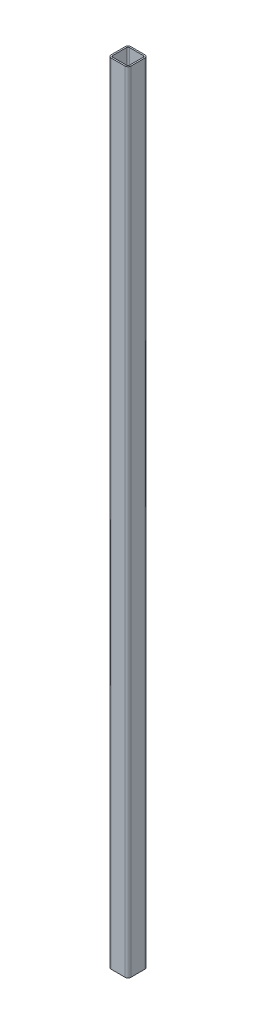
from build123d import *

# Parameters (mm, degrees)
EXTRU_MINCE1_DEPTH = 400


with BuildPart() as part:
    # Esquisse1 → Extru.-Mince1 (new, symmetric)
    with BuildSketch(Plane(origin=(0, 0, 0), x_dir=(1, 0, 0), z_dir=(0, 1, 0))):
        with BuildLine():
            Line((7, 10), (-7, 10))
            ThreePointArc((-7, 10), (-9.121320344, 9.121320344), (-10, 7))
            Line((-10, 7), (-10, -7))
            ThreePointArc((-10, -7), (-9.121320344, -9.121320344), (-7, -10))
            Line((-7, -10), (7, -10))
            ThreePointArc((7, -10), (9.121320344, -9.121320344), (10, -7))
            Line((10, -7), (10, 7))
            ThreePointArc((10, 7), (9.121320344, 9.121320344), (7, 10))
        make_face()
        with BuildLine():
            Line((7, 8.5), (-7, 8.5))
            ThreePointArc((-7, 8.5), (-8.060660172, 8.060660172), (-8.5, 7))
            Line((-8.5, 7), (-8.5, -7))
            ThreePointArc((-8.5, -7), (-8.060660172, -8.060660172), (-7, -8.5))
            Line((-7, -8.5), (7, -8.5))
            ThreePointArc((7, -8.5), (8.060660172, -8.060660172), (8.5, -7))
            Line((8.5, -7), (8.5, 7))
            ThreePointArc((8.5, 7), (8.060660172, 8.060660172), (7, 8.5))
        make_face(mode=Mode.SUBTRACT)
    extrude(amount=EXTRU_MINCE1_DEPTH, both=True)


solid = part.part
